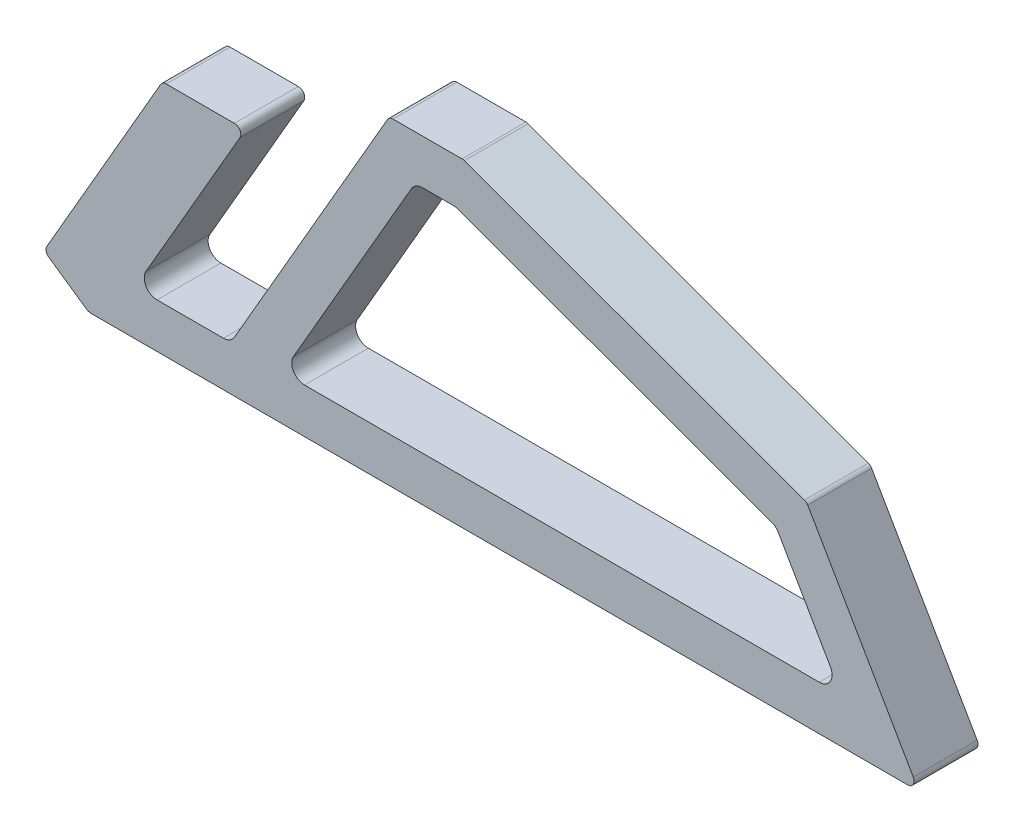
ISO-10303-21;
HEADER;
FILE_DESCRIPTION(('STEP AP214'),'2;1');
FILE_NAME('part.step','',(''),(''),'','','');
FILE_SCHEMA(('AUTOMOTIVE_DESIGN { 1 0 10303 214 1 1 1 1 }'));
ENDSEC;
DATA;
#1=APPLICATION_CONTEXT('core data for automotive mechanical design processes');
#2=APPLICATION_PROTOCOL_DEFINITION('international standard','automotive_design',2000,#1);
#3=PRODUCT_CONTEXT('',#1,'mechanical');
#4=PRODUCT('Part','Part','',(#3));
#5=PRODUCT_RELATED_PRODUCT_CATEGORY('part','',(#4));
#6=PRODUCT_DEFINITION_FORMATION('','',#4);
#7=PRODUCT_DEFINITION_CONTEXT('part definition',#1,'design');
#8=PRODUCT_DEFINITION('design','',#6,#7);
#9=PRODUCT_DEFINITION_SHAPE('','',#8);
#10=(LENGTH_UNIT() NAMED_UNIT(*) SI_UNIT(.MILLI.,.METRE.));
#11=(NAMED_UNIT(*) PLANE_ANGLE_UNIT() SI_UNIT($,.RADIAN.));
#12=(NAMED_UNIT(*) SI_UNIT($,.STERADIAN.) SOLID_ANGLE_UNIT());
#13=UNCERTAINTY_MEASURE_WITH_UNIT(LENGTH_MEASURE(1.E-05),#10,'distance_accuracy_value','');
#14=(GEOMETRIC_REPRESENTATION_CONTEXT(3) GLOBAL_UNCERTAINTY_ASSIGNED_CONTEXT((#13)) GLOBAL_UNIT_ASSIGNED_CONTEXT((#10,
#11,#12)) REPRESENTATION_CONTEXT('',''));
#15=CARTESIAN_POINT('',(0.,0.,0.));
#16=DIRECTION('',(0.,0.,1.));
#17=DIRECTION('',(1.,0.,0.));
#18=AXIS2_PLACEMENT_3D('',#15,#16,#17);
#19=CARTESIAN_POINT('',(0.,0.,10.));
#20=DIRECTION('',(0.,0.,-1.));
#21=DIRECTION('',(-1.,0.,0.));
#22=AXIS2_PLACEMENT_3D('',#19,#20,#21);
#23=PLANE('',#22);
#24=DIRECTION('',(-0.499999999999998,-0.86602540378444,0.));
#25=VECTOR('',#24,1.);
#26=CARTESIAN_POINT('',(-7.,4.83924431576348,10.));
#27=LINE('',#26,#25);
#28=CARTESIAN_POINT('',(11.2793458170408,36.5,10.));
#29=VERTEX_POINT('',#28);
#30=CARTESIAN_POINT('',(-6.53907278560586,5.63759366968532,10.));
#31=VERTEX_POINT('',#30);
#32=EDGE_CURVE('E251',#29,#31,#27,.T.);
#33=ORIENTED_EDGE('',*,*,#32,.T.);
#34=CARTESIAN_POINT('',(-5.67304738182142,5.13759366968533,10.));
#35=DIRECTION('',(0.,0.,-1.));
#36=DIRECTION('',(-1.,0.,0.));
#37=AXIS2_PLACEMENT_3D('',#34,#35,#36);
#38=CIRCLE('',#37,1.);
#39=CARTESIAN_POINT('',(-6.24170836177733,4.31502167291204,10.));
#40=VERTEX_POINT('',#39);
#41=EDGE_CURVE('E364',#31,#40,#38,.F.);
#42=ORIENTED_EDGE('',*,*,#41,.T.);
#43=DIRECTION('',(0.822571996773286,-0.568660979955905,0.));
#44=VECTOR('',#43,1.);
#45=CARTESIAN_POINT('',(-7.,4.83924431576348,10.));
#46=LINE('',#45,#44);
#47=CARTESIAN_POINT('',(-0.256650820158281,0.177428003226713,10.));
#48=VERTEX_POINT('',#47);
#49=EDGE_CURVE('E268',#40,#48,#46,.T.);
#50=ORIENTED_EDGE('',*,*,#49,.T.);
#51=CARTESIAN_POINT('',(0.312010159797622,1.,10.));
#52=DIRECTION('',(0.,0.,-1.));
#53=DIRECTION('',(-1.,0.,0.));
#54=AXIS2_PLACEMENT_3D('',#51,#52,#53);
#55=CIRCLE('',#54,1.);
#56=CARTESIAN_POINT('',(0.312010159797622,0.,10.));
#57=VERTEX_POINT('',#56);
#58=EDGE_CURVE('E354',#48,#57,#55,.F.);
#59=ORIENTED_EDGE('',*,*,#58,.T.);
#60=DIRECTION('',(1.,0.,0.));
#61=VECTOR('',#60,1.);
#62=CARTESIAN_POINT('',(0.,0.,10.));
#63=LINE('',#62,#61);
#64=CARTESIAN_POINT('',(128.267949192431,0.,10.));
#65=VERTEX_POINT('',#64);
#66=EDGE_CURVE('E452',#57,#65,#63,.T.);
#67=ORIENTED_EDGE('',*,*,#66,.T.);
#68=CARTESIAN_POINT('',(128.267949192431,1.,10.));
#69=DIRECTION('',(0.,0.,-1.));
#70=DIRECTION('',(-1.,0.,0.));
#71=AXIS2_PLACEMENT_3D('',#68,#69,#70);
#72=CIRCLE('',#71,1.);
#73=CARTESIAN_POINT('',(129.133974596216,1.5,10.));
#74=VERTEX_POINT('',#73);
#75=EDGE_CURVE('E356',#65,#74,#72,.F.);
#76=ORIENTED_EDGE('',*,*,#75,.T.);
#77=DIRECTION('',(-0.500000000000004,0.866025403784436,0.));
#78=VECTOR('',#77,1.);
#79=CARTESIAN_POINT('',(130.,0.,10.));
#80=LINE('',#79,#78);
#81=CARTESIAN_POINT('',(112.615245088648,30.1112787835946,10.));
#82=VERTEX_POINT('',#81);
#83=EDGE_CURVE('E449',#74,#82,#80,.T.);
#84=ORIENTED_EDGE('',*,*,#83,.T.);
#85=CARTESIAN_POINT('',(111.749219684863,29.6112787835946,10.));
#86=DIRECTION('',(0.,0.,-1.));
#87=DIRECTION('',(-1.,0.,0.));
#88=AXIS2_PLACEMENT_3D('',#85,#86,#87);
#89=CIRCLE('',#88,1.);
#90=CARTESIAN_POINT('',(112.091239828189,30.5509714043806,10.));
#91=VERTEX_POINT('',#90);
#92=EDGE_CURVE('E358',#82,#91,#89,.F.);
#93=ORIENTED_EDGE('',*,*,#92,.T.);
#94=DIRECTION('',(-0.93969262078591,0.342020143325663,0.));
#95=VECTOR('',#94,1.);
#96=CARTESIAN_POINT('',(112.433259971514,30.4264862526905,10.));
#97=LINE('',#96,#95);
#98=CARTESIAN_POINT('',(58.8211660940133,49.9396926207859,10.));
#99=VERTEX_POINT('',#98);
#100=EDGE_CURVE('E446',#91,#99,#97,.T.);
#101=ORIENTED_EDGE('',*,*,#100,.T.);
#102=CARTESIAN_POINT('',(58.4791459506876,49.,10.));
#103=DIRECTION('',(0.,0.,-1.));
#104=DIRECTION('',(-1.,0.,0.));
#105=AXIS2_PLACEMENT_3D('',#102,#103,#104);
#106=CIRCLE('',#105,1.);
#107=CARTESIAN_POINT('',(58.4791459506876,50.,10.));
#108=VERTEX_POINT('',#107);
#109=EDGE_CURVE('E360',#99,#108,#106,.F.);
#110=ORIENTED_EDGE('',*,*,#109,.T.);
#111=DIRECTION('',(-1.,0.,0.));
#112=VECTOR('',#111,1.);
#113=CARTESIAN_POINT('',(47.084681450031,50.,10.));
#114=LINE('',#113,#112);
#115=CARTESIAN_POINT('',(47.6620317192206,50.,10.));
#116=VERTEX_POINT('',#115);
#117=EDGE_CURVE('E441',#108,#116,#114,.T.);
#118=ORIENTED_EDGE('',*,*,#117,.T.);
#119=CARTESIAN_POINT('',(47.6620317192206,49.,10.));
#120=DIRECTION('',(0.,0.,-1.));
#121=DIRECTION('',(-1.,0.,0.));
#122=AXIS2_PLACEMENT_3D('',#119,#120,#121);
#123=CIRCLE('',#122,1.);
#124=CARTESIAN_POINT('',(46.7960063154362,49.5,10.));
#125=VERTEX_POINT('',#124);
#126=EDGE_CURVE('E362',#116,#125,#123,.F.);
#127=ORIENTED_EDGE('',*,*,#126,.T.);
#128=DIRECTION('',(-0.499999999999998,-0.86602540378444,0.));
#129=VECTOR('',#128,1.);
#130=CARTESIAN_POINT('',(47.084681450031,50.,10.));
#131=LINE('',#130,#129);
#132=CARTESIAN_POINT('',(22.8359701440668,8.00000000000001,10.));
#133=VERTEX_POINT('',#132);
#134=EDGE_CURVE('E437',#125,#133,#131,.T.);
#135=ORIENTED_EDGE('',*,*,#134,.T.);
#136=CARTESIAN_POINT('',(21.103919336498,8.99999999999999,10.));
#137=DIRECTION('',(0.,0.,-1.));
#138=DIRECTION('',(-1.,0.,0.));
#139=AXIS2_PLACEMENT_3D('',#136,#137,#138);
#140=CIRCLE('',#139,2.);
#141=CARTESIAN_POINT('',(21.103919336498,6.99999999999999,10.));
#142=VERTEX_POINT('',#141);
#143=EDGE_CURVE('E304',#133,#142,#140,.T.);
#144=ORIENTED_EDGE('',*,*,#143,.T.);
#145=DIRECTION('',(-1.,0.,0.));
#146=VECTOR('',#145,1.);
#147=CARTESIAN_POINT('',(22.2586198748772,6.99999999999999,10.));
#148=LINE('',#147,#146);
#149=CARTESIAN_POINT('',(10.7116144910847,7.,10.));
#150=VERTEX_POINT('',#149);
#151=EDGE_CURVE('E436',#142,#150,#148,.T.);
#152=ORIENTED_EDGE('',*,*,#151,.T.);
#153=CARTESIAN_POINT('',(10.7116144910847,9.,10.));
#154=DIRECTION('',(0.,0.,-1.));
#155=DIRECTION('',(-1.,0.,0.));
#156=AXIS2_PLACEMENT_3D('',#153,#154,#155);
#157=CIRCLE('',#156,2.);
#158=CARTESIAN_POINT('',(8.97956368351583,10.,10.));
#159=VERTEX_POINT('',#158);
#160=EDGE_CURVE('E240',#150,#159,#157,.T.);
#161=ORIENTED_EDGE('',*,*,#160,.T.);
#162=DIRECTION('',(0.499999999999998,0.86602540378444,0.));
#163=VECTOR('',#162,1.);
#164=CARTESIAN_POINT('',(24.5680209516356,37.,10.));
#165=LINE('',#164,#163);
#166=CARTESIAN_POINT('',(23.7019955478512,35.5,10.));
#167=VERTEX_POINT('',#166);
#168=EDGE_CURVE('E249',#159,#167,#165,.T.);
#169=ORIENTED_EDGE('',*,*,#168,.T.);
#170=CARTESIAN_POINT('',(22.8359701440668,36.,10.));
#171=DIRECTION('',(0.,0.,-1.));
#172=DIRECTION('',(-1.,0.,0.));
#173=AXIS2_PLACEMENT_3D('',#170,#171,#172);
#174=CIRCLE('',#173,1.);
#175=CARTESIAN_POINT('',(22.8359701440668,37.,10.));
#176=VERTEX_POINT('',#175);
#177=EDGE_CURVE('E54',#167,#176,#174,.F.);
#178=ORIENTED_EDGE('',*,*,#177,.T.);
#179=DIRECTION('',(-1.,0.,0.));
#180=VECTOR('',#179,1.);
#181=CARTESIAN_POINT('',(11.5680209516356,37.,10.));
#182=LINE('',#181,#180);
#183=CARTESIAN_POINT('',(12.1453712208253,37.,10.));
#184=VERTEX_POINT('',#183);
#185=EDGE_CURVE('E392',#176,#184,#182,.T.);
#186=ORIENTED_EDGE('',*,*,#185,.T.);
#187=CARTESIAN_POINT('',(12.1453712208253,36.,10.));
#188=DIRECTION('',(0.,0.,-1.));
#189=DIRECTION('',(-1.,0.,0.));
#190=AXIS2_PLACEMENT_3D('',#187,#188,#189);
#191=CIRCLE('',#190,1.);
#192=EDGE_CURVE('E351',#184,#29,#191,.F.);
#193=ORIENTED_EDGE('',*,*,#192,.T.);
#194=EDGE_LOOP('',(#33,#42,#50,#59,#67,#76,#84,#93,#101,#110,#118,#127,#135,#144,#152,#161,#169,
#178,#186,#193));
#195=FACE_BOUND('',#194,.T.);
#196=DIRECTION('',(-0.500000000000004,0.866025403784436,0.));
#197=VECTOR('',#196,1.);
#198=CARTESIAN_POINT('',(117.875644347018,7.,10.));
#199=LINE('',#198,#197);
#200=CARTESIAN_POINT('',(116.143593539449,10.,10.));
#201=VERTEX_POINT('',#200);
#202=CARTESIAN_POINT('',(108.008948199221,24.0896190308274,10.));
#203=VERTEX_POINT('',#202);
#204=EDGE_CURVE('E460',#201,#203,#199,.T.);
#205=ORIENTED_EDGE('',*,*,#204,.F.);
#206=CARTESIAN_POINT('',(114.41154273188,9.,10.));
#207=DIRECTION('',(0.,0.,-1.));
#208=DIRECTION('',(-1.,0.,0.));
#209=AXIS2_PLACEMENT_3D('',#206,#207,#208);
#210=CIRCLE('',#209,2.);
#211=CARTESIAN_POINT('',(114.41154273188,7.,10.));
#212=VERTEX_POINT('',#211);
#213=EDGE_CURVE('E316',#201,#212,#210,.T.);
#214=ORIENTED_EDGE('',*,*,#213,.T.);
#215=DIRECTION('',(1.,0.,0.));
#216=VECTOR('',#215,1.);
#217=CARTESIAN_POINT('',(30.341523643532,7.,10.));
#218=LINE('',#217,#216);
#219=CARTESIAN_POINT('',(33.8056252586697,7.,10.));
#220=VERTEX_POINT('',#219);
#221=EDGE_CURVE('E412',#220,#212,#218,.T.);
#222=ORIENTED_EDGE('',*,*,#221,.F.);
#223=CARTESIAN_POINT('',(33.8056252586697,9.,10.));
#224=DIRECTION('',(0.,0.,-1.));
#225=DIRECTION('',(-1.,0.,0.));
#226=AXIS2_PLACEMENT_3D('',#223,#224,#225);
#227=CIRCLE('',#226,2.);
#228=CARTESIAN_POINT('',(32.0735744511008,9.99999999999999,10.));
#229=VERTEX_POINT('',#228);
#230=EDGE_CURVE('E312',#220,#229,#227,.T.);
#231=ORIENTED_EDGE('',*,*,#230,.T.);
#232=DIRECTION('',(-0.499999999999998,-0.86602540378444,0.));
#233=VECTOR('',#232,1.);
#234=CARTESIAN_POINT('',(51.1261333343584,43.,10.));
#235=LINE('',#234,#233);
#236=CARTESIAN_POINT('',(50.5487830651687,42.,10.));
#237=VERTEX_POINT('',#236);
#238=EDGE_CURVE('E475',#237,#229,#235,.T.);
#239=ORIENTED_EDGE('',*,*,#238,.F.);
#240=CARTESIAN_POINT('',(52.2808338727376,41.,10.));
#241=DIRECTION('',(0.,0.,-1.));
#242=DIRECTION('',(-1.,0.,0.));
#243=AXIS2_PLACEMENT_3D('',#240,#241,#242);
#244=CIRCLE('',#243,2.);
#245=CARTESIAN_POINT('',(52.2808338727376,43.,10.));
#246=VERTEX_POINT('',#245);
#247=EDGE_CURVE('E320',#237,#246,#244,.T.);
#248=ORIENTED_EDGE('',*,*,#247,.T.);
#249=DIRECTION('',(-1.,0.,0.));
#250=VECTOR('',#249,1.);
#251=CARTESIAN_POINT('',(51.1261333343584,43.,10.));
#252=LINE('',#251,#250);
#253=CARTESIAN_POINT('',(57.06853010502,43.,10.));
#254=VERTEX_POINT('',#253);
#255=EDGE_CURVE('E478',#254,#246,#252,.T.);
#256=ORIENTED_EDGE('',*,*,#255,.F.);
#257=CARTESIAN_POINT('',(57.06853010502,41.,10.));
#258=DIRECTION('',(0.,0.,-1.));
#259=DIRECTION('',(-1.,0.,0.));
#260=AXIS2_PLACEMENT_3D('',#257,#258,#259);
#261=CIRCLE('',#260,2.);
#262=CARTESIAN_POINT('',(57.7525703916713,42.8793852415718,10.));
#263=VERTEX_POINT('',#262);
#264=EDGE_CURVE('E324',#254,#263,#261,.T.);
#265=ORIENTED_EDGE('',*,*,#264,.T.);
#266=DIRECTION('',(-0.939692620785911,0.342020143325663,0.));
#267=VECTOR('',#266,1.);
#268=CARTESIAN_POINT('',(107.644977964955,24.7200339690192,10.));
#269=LINE('',#268,#267);
#270=CARTESIAN_POINT('',(106.960937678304,24.9690042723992,10.));
#271=VERTEX_POINT('',#270);
#272=EDGE_CURVE('E481',#271,#263,#269,.T.);
#273=ORIENTED_EDGE('',*,*,#272,.F.);
#274=CARTESIAN_POINT('',(106.276897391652,23.0896190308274,10.));
#275=DIRECTION('',(0.,0.,-1.));
#276=DIRECTION('',(-1.,0.,0.));
#277=AXIS2_PLACEMENT_3D('',#274,#275,#276);
#278=CIRCLE('',#277,2.);
#279=EDGE_CURVE('E308',#271,#203,#278,.T.);
#280=ORIENTED_EDGE('',*,*,#279,.T.);
#281=EDGE_LOOP('',(#205,#214,#222,#231,#239,#248,#256,#265,#273,#280));
#282=FACE_BOUND('',#281,.T.);
#283=ADVANCED_FACE('F32',(#195,#282),#23,.F.);
#284=CARTESIAN_POINT('',(0.,0.,0.));
#285=DIRECTION('',(0.,0.,-1.));
#286=DIRECTION('',(-1.,0.,0.));
#287=AXIS2_PLACEMENT_3D('',#284,#285,#286);
#288=PLANE('',#287);
#289=DIRECTION('',(0.822571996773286,-0.568660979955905,0.));
#290=VECTOR('',#289,1.);
#291=CARTESIAN_POINT('',(-7.,4.83924431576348,0.));
#292=LINE('',#291,#290);
#293=CARTESIAN_POINT('',(-6.24170836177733,4.31502167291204,0.));
#294=VERTEX_POINT('',#293);
#295=CARTESIAN_POINT('',(-0.256650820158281,0.177428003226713,0.));
#296=VERTEX_POINT('',#295);
#297=EDGE_CURVE('E408',#294,#296,#292,.T.);
#298=ORIENTED_EDGE('',*,*,#297,.F.);
#299=CARTESIAN_POINT('',(-5.67304738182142,5.13759366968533,0.));
#300=DIRECTION('',(0.,0.,-1.));
#301=DIRECTION('',(-1.,0.,0.));
#302=AXIS2_PLACEMENT_3D('',#299,#300,#301);
#303=CIRCLE('',#302,1.);
#304=CARTESIAN_POINT('',(-6.53907278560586,5.63759366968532,0.));
#305=VERTEX_POINT('',#304);
#306=EDGE_CURVE('E344',#294,#305,#303,.T.);
#307=ORIENTED_EDGE('',*,*,#306,.T.);
#308=DIRECTION('',(-0.499999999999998,-0.86602540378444,0.));
#309=VECTOR('',#308,1.);
#310=CARTESIAN_POINT('',(-7.,4.83924431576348,0.));
#311=LINE('',#310,#309);
#312=CARTESIAN_POINT('',(11.2793458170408,36.5,0.));
#313=VERTEX_POINT('',#312);
#314=EDGE_CURVE('E261',#313,#305,#311,.T.);
#315=ORIENTED_EDGE('',*,*,#314,.F.);
#316=CARTESIAN_POINT('',(12.1453712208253,36.,0.));
#317=DIRECTION('',(0.,0.,-1.));
#318=DIRECTION('',(-1.,0.,0.));
#319=AXIS2_PLACEMENT_3D('',#316,#317,#318);
#320=CIRCLE('',#319,1.);
#321=CARTESIAN_POINT('',(12.1453712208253,37.,0.));
#322=VERTEX_POINT('',#321);
#323=EDGE_CURVE('E331',#313,#322,#320,.T.);
#324=ORIENTED_EDGE('',*,*,#323,.T.);
#325=DIRECTION('',(-1.,0.,0.));
#326=VECTOR('',#325,1.);
#327=CARTESIAN_POINT('',(11.5680209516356,37.,0.));
#328=LINE('',#327,#326);
#329=CARTESIAN_POINT('',(22.8359701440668,37.,0.));
#330=VERTEX_POINT('',#329);
#331=EDGE_CURVE('E258',#330,#322,#328,.T.);
#332=ORIENTED_EDGE('',*,*,#331,.F.);
#333=CARTESIAN_POINT('',(22.8359701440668,36.,0.));
#334=DIRECTION('',(0.,0.,-1.));
#335=DIRECTION('',(-1.,0.,0.));
#336=AXIS2_PLACEMENT_3D('',#333,#334,#335);
#337=CIRCLE('',#336,1.);
#338=CARTESIAN_POINT('',(23.7019955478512,35.5,0.));
#339=VERTEX_POINT('',#338);
#340=EDGE_CURVE('E257',#330,#339,#337,.T.);
#341=ORIENTED_EDGE('',*,*,#340,.T.);
#342=DIRECTION('',(0.499999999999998,0.86602540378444,0.));
#343=VECTOR('',#342,1.);
#344=CARTESIAN_POINT('',(24.5680209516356,37.,0.));
#345=LINE('',#344,#343);
#346=CARTESIAN_POINT('',(8.97956368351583,10.,0.));
#347=VERTEX_POINT('',#346);
#348=EDGE_CURVE('E247',#347,#339,#345,.T.);
#349=ORIENTED_EDGE('',*,*,#348,.F.);
#350=CARTESIAN_POINT('',(10.7116144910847,9.,0.));
#351=DIRECTION('',(0.,0.,-1.));
#352=DIRECTION('',(-1.,0.,0.));
#353=AXIS2_PLACEMENT_3D('',#350,#351,#352);
#354=CIRCLE('',#353,2.);
#355=CARTESIAN_POINT('',(10.7116144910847,7.,0.));
#356=VERTEX_POINT('',#355);
#357=EDGE_CURVE('E230',#347,#356,#354,.F.);
#358=ORIENTED_EDGE('',*,*,#357,.T.);
#359=DIRECTION('',(-1.,0.,0.));
#360=VECTOR('',#359,1.);
#361=CARTESIAN_POINT('',(22.2586198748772,6.99999999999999,0.));
#362=LINE('',#361,#360);
#363=CARTESIAN_POINT('',(21.103919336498,6.99999999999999,0.));
#364=VERTEX_POINT('',#363);
#365=EDGE_CURVE('E259',#364,#356,#362,.T.);
#366=ORIENTED_EDGE('',*,*,#365,.F.);
#367=CARTESIAN_POINT('',(21.103919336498,8.99999999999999,0.));
#368=DIRECTION('',(0.,0.,-1.));
#369=DIRECTION('',(-1.,0.,0.));
#370=AXIS2_PLACEMENT_3D('',#367,#368,#369);
#371=CIRCLE('',#370,2.);
#372=CARTESIAN_POINT('',(22.8359701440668,8.00000000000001,0.));
#373=VERTEX_POINT('',#372);
#374=EDGE_CURVE('E301',#364,#373,#371,.F.);
#375=ORIENTED_EDGE('',*,*,#374,.T.);
#376=DIRECTION('',(-0.499999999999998,-0.86602540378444,0.));
#377=VECTOR('',#376,1.);
#378=CARTESIAN_POINT('',(47.084681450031,50.,0.));
#379=LINE('',#378,#377);
#380=CARTESIAN_POINT('',(46.7960063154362,49.5,0.));
#381=VERTEX_POINT('',#380);
#382=EDGE_CURVE('E263',#381,#373,#379,.T.);
#383=ORIENTED_EDGE('',*,*,#382,.F.);
#384=CARTESIAN_POINT('',(47.6620317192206,49.,0.));
#385=DIRECTION('',(0.,0.,-1.));
#386=DIRECTION('',(-1.,0.,0.));
#387=AXIS2_PLACEMENT_3D('',#384,#385,#386);
#388=CIRCLE('',#387,1.);
#389=CARTESIAN_POINT('',(47.6620317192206,50.,0.));
#390=VERTEX_POINT('',#389);
#391=EDGE_CURVE('E342',#381,#390,#388,.T.);
#392=ORIENTED_EDGE('',*,*,#391,.T.);
#393=DIRECTION('',(-1.,0.,0.));
#394=VECTOR('',#393,1.);
#395=CARTESIAN_POINT('',(47.084681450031,50.,0.));
#396=LINE('',#395,#394);
#397=CARTESIAN_POINT('',(58.4791459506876,50.,0.));
#398=VERTEX_POINT('',#397);
#399=EDGE_CURVE('E421',#398,#390,#396,.T.);
#400=ORIENTED_EDGE('',*,*,#399,.F.);
#401=CARTESIAN_POINT('',(58.4791459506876,49.,0.));
#402=DIRECTION('',(0.,0.,-1.));
#403=DIRECTION('',(-1.,0.,0.));
#404=AXIS2_PLACEMENT_3D('',#401,#402,#403);
#405=CIRCLE('',#404,1.);
#406=CARTESIAN_POINT('',(58.8211660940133,49.9396926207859,0.));
#407=VERTEX_POINT('',#406);
#408=EDGE_CURVE('E340',#398,#407,#405,.T.);
#409=ORIENTED_EDGE('',*,*,#408,.T.);
#410=DIRECTION('',(-0.93969262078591,0.342020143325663,0.));
#411=VECTOR('',#410,1.);
#412=CARTESIAN_POINT('',(112.433259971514,30.4264862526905,0.));
#413=LINE('',#412,#411);
#414=CARTESIAN_POINT('',(112.091239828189,30.5509714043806,0.));
#415=VERTEX_POINT('',#414);
#416=EDGE_CURVE('E418',#415,#407,#413,.T.);
#417=ORIENTED_EDGE('',*,*,#416,.F.);
#418=CARTESIAN_POINT('',(111.749219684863,29.6112787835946,0.));
#419=DIRECTION('',(0.,0.,-1.));
#420=DIRECTION('',(-1.,0.,0.));
#421=AXIS2_PLACEMENT_3D('',#418,#419,#420);
#422=CIRCLE('',#421,1.);
#423=CARTESIAN_POINT('',(112.615245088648,30.1112787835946,0.));
#424=VERTEX_POINT('',#423);
#425=EDGE_CURVE('E338',#415,#424,#422,.T.);
#426=ORIENTED_EDGE('',*,*,#425,.T.);
#427=DIRECTION('',(-0.500000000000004,0.866025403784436,0.));
#428=VECTOR('',#427,1.);
#429=CARTESIAN_POINT('',(130.,0.,0.));
#430=LINE('',#429,#428);
#431=CARTESIAN_POINT('',(129.133974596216,1.5,0.));
#432=VERTEX_POINT('',#431);
#433=EDGE_CURVE('E415',#432,#424,#430,.T.);
#434=ORIENTED_EDGE('',*,*,#433,.F.);
#435=CARTESIAN_POINT('',(128.267949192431,1.,0.));
#436=DIRECTION('',(0.,0.,-1.));
#437=DIRECTION('',(-1.,0.,0.));
#438=AXIS2_PLACEMENT_3D('',#435,#436,#437);
#439=CIRCLE('',#438,1.);
#440=CARTESIAN_POINT('',(128.267949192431,0.,0.));
#441=VERTEX_POINT('',#440);
#442=EDGE_CURVE('E336',#432,#441,#439,.T.);
#443=ORIENTED_EDGE('',*,*,#442,.T.);
#444=DIRECTION('',(1.,0.,0.));
#445=VECTOR('',#444,1.);
#446=CARTESIAN_POINT('',(0.,0.,0.));
#447=LINE('',#446,#445);
#448=CARTESIAN_POINT('',(0.312010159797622,0.,0.));
#449=VERTEX_POINT('',#448);
#450=EDGE_CURVE('E411',#449,#441,#447,.T.);
#451=ORIENTED_EDGE('',*,*,#450,.F.);
#452=CARTESIAN_POINT('',(0.312010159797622,1.,0.));
#453=DIRECTION('',(0.,0.,-1.));
#454=DIRECTION('',(-1.,0.,0.));
#455=AXIS2_PLACEMENT_3D('',#452,#453,#454);
#456=CIRCLE('',#455,1.);
#457=EDGE_CURVE('E334',#449,#296,#456,.T.);
#458=ORIENTED_EDGE('',*,*,#457,.T.);
#459=EDGE_LOOP('',(#298,#307,#315,#324,#332,#341,#349,#358,#366,#375,#383,#392,#400,#409,#417,
#426,#434,#443,#451,#458));
#460=FACE_BOUND('',#459,.T.);
#461=DIRECTION('',(-0.499999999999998,-0.86602540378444,0.));
#462=VECTOR('',#461,1.);
#463=CARTESIAN_POINT('',(51.1261333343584,43.,0.));
#464=LINE('',#463,#462);
#465=CARTESIAN_POINT('',(50.5487830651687,42.,0.));
#466=VERTEX_POINT('',#465);
#467=CARTESIAN_POINT('',(32.0735744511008,9.99999999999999,0.));
#468=VERTEX_POINT('',#467);
#469=EDGE_CURVE('E461',#466,#468,#464,.T.);
#470=ORIENTED_EDGE('',*,*,#469,.T.);
#471=CARTESIAN_POINT('',(33.8056252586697,9.,0.));
#472=DIRECTION('',(0.,0.,-1.));
#473=DIRECTION('',(-1.,0.,0.));
#474=AXIS2_PLACEMENT_3D('',#471,#472,#473);
#475=CIRCLE('',#474,2.);
#476=CARTESIAN_POINT('',(33.8056252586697,7.,0.));
#477=VERTEX_POINT('',#476);
#478=EDGE_CURVE('E310',#468,#477,#475,.F.);
#479=ORIENTED_EDGE('',*,*,#478,.T.);
#480=DIRECTION('',(1.,0.,0.));
#481=VECTOR('',#480,1.);
#482=CARTESIAN_POINT('',(30.341523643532,7.,0.));
#483=LINE('',#482,#481);
#484=CARTESIAN_POINT('',(114.41154273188,7.,0.));
#485=VERTEX_POINT('',#484);
#486=EDGE_CURVE('E457',#477,#485,#483,.T.);
#487=ORIENTED_EDGE('',*,*,#486,.T.);
#488=CARTESIAN_POINT('',(114.41154273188,9.,0.));
#489=DIRECTION('',(0.,0.,-1.));
#490=DIRECTION('',(-1.,0.,0.));
#491=AXIS2_PLACEMENT_3D('',#488,#489,#490);
#492=CIRCLE('',#491,2.);
#493=CARTESIAN_POINT('',(116.143593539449,10.,0.));
#494=VERTEX_POINT('',#493);
#495=EDGE_CURVE('E314',#485,#494,#492,.F.);
#496=ORIENTED_EDGE('',*,*,#495,.T.);
#497=DIRECTION('',(-0.500000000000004,0.866025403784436,0.));
#498=VECTOR('',#497,1.);
#499=CARTESIAN_POINT('',(117.875644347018,7.,0.));
#500=LINE('',#499,#498);
#501=CARTESIAN_POINT('',(108.008948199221,24.0896190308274,0.));
#502=VERTEX_POINT('',#501);
#503=EDGE_CURVE('E470',#494,#502,#500,.T.);
#504=ORIENTED_EDGE('',*,*,#503,.T.);
#505=CARTESIAN_POINT('',(106.276897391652,23.0896190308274,0.));
#506=DIRECTION('',(0.,0.,-1.));
#507=DIRECTION('',(-1.,0.,0.));
#508=AXIS2_PLACEMENT_3D('',#505,#506,#507);
#509=CIRCLE('',#508,2.);
#510=CARTESIAN_POINT('',(106.960937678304,24.9690042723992,0.));
#511=VERTEX_POINT('',#510);
#512=EDGE_CURVE('E306',#502,#511,#509,.F.);
#513=ORIENTED_EDGE('',*,*,#512,.T.);
#514=DIRECTION('',(-0.939692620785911,0.342020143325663,0.));
#515=VECTOR('',#514,1.);
#516=CARTESIAN_POINT('',(107.644977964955,24.7200339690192,0.));
#517=LINE('',#516,#515);
#518=CARTESIAN_POINT('',(57.7525703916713,42.8793852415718,0.));
#519=VERTEX_POINT('',#518);
#520=EDGE_CURVE('E467',#511,#519,#517,.T.);
#521=ORIENTED_EDGE('',*,*,#520,.T.);
#522=CARTESIAN_POINT('',(57.06853010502,41.,0.));
#523=DIRECTION('',(0.,0.,-1.));
#524=DIRECTION('',(-1.,0.,0.));
#525=AXIS2_PLACEMENT_3D('',#522,#523,#524);
#526=CIRCLE('',#525,2.);
#527=CARTESIAN_POINT('',(57.06853010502,43.,0.));
#528=VERTEX_POINT('',#527);
#529=EDGE_CURVE('E322',#519,#528,#526,.F.);
#530=ORIENTED_EDGE('',*,*,#529,.T.);
#531=DIRECTION('',(-1.,0.,0.));
#532=VECTOR('',#531,1.);
#533=CARTESIAN_POINT('',(51.1261333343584,43.,0.));
#534=LINE('',#533,#532);
#535=CARTESIAN_POINT('',(52.2808338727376,43.,0.));
#536=VERTEX_POINT('',#535);
#537=EDGE_CURVE('E464',#528,#536,#534,.T.);
#538=ORIENTED_EDGE('',*,*,#537,.T.);
#539=CARTESIAN_POINT('',(52.2808338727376,41.,0.));
#540=DIRECTION('',(0.,0.,-1.));
#541=DIRECTION('',(-1.,0.,0.));
#542=AXIS2_PLACEMENT_3D('',#539,#540,#541);
#543=CIRCLE('',#542,2.);
#544=EDGE_CURVE('E318',#536,#466,#543,.F.);
#545=ORIENTED_EDGE('',*,*,#544,.T.);
#546=EDGE_LOOP('',(#470,#479,#487,#496,#504,#513,#521,#530,#538,#545));
#547=FACE_BOUND('',#546,.T.);
#548=ADVANCED_FACE('F254',(#460,#547),#288,.T.);
#549=CARTESIAN_POINT('',(-7.,4.83924431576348,10.));
#550=DIRECTION('',(0.568660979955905,0.822571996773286,0.));
#551=DIRECTION('',(-0.822571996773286,0.568660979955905,0.));
#552=AXIS2_PLACEMENT_3D('',#549,#550,#551);
#553=PLANE('',#552);
#554=ORIENTED_EDGE('',*,*,#49,.F.);
#555=DIRECTION('',(0.,0.,-1.));
#556=VECTOR('',#555,1.);
#557=CARTESIAN_POINT('',(-6.24170836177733,4.31502167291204,10.));
#558=LINE('',#557,#556);
#559=EDGE_CURVE('E328',#40,#294,#558,.T.);
#560=ORIENTED_EDGE('',*,*,#559,.T.);
#561=ORIENTED_EDGE('',*,*,#297,.T.);
#562=DIRECTION('',(0.,0.,-1.));
#563=VECTOR('',#562,1.);
#564=CARTESIAN_POINT('',(-0.256650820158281,0.177428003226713,10.));
#565=LINE('',#564,#563);
#566=EDGE_CURVE('E326',#296,#48,#565,.F.);
#567=ORIENTED_EDGE('',*,*,#566,.T.);
#568=EDGE_LOOP('',(#554,#560,#561,#567));
#569=FACE_BOUND('',#568,.T.);
#570=ADVANCED_FACE('F535',(#569),#553,.F.);
#571=CARTESIAN_POINT('',(0.,0.,10.));
#572=DIRECTION('',(0.,1.,0.));
#573=DIRECTION('',(0.,0.,1.));
#574=AXIS2_PLACEMENT_3D('',#571,#572,#573);
#575=PLANE('',#574);
#576=ORIENTED_EDGE('',*,*,#450,.T.);
#577=DIRECTION('',(0.,0.,-1.));
#578=VECTOR('',#577,1.);
#579=CARTESIAN_POINT('',(128.267949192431,0.,10.));
#580=LINE('',#579,#578);
#581=EDGE_CURVE('E387',#441,#65,#580,.F.);
#582=ORIENTED_EDGE('',*,*,#581,.T.);
#583=ORIENTED_EDGE('',*,*,#66,.F.);
#584=DIRECTION('',(0.,0.,-1.));
#585=VECTOR('',#584,1.);
#586=CARTESIAN_POINT('',(0.312010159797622,0.,10.));
#587=LINE('',#586,#585);
#588=EDGE_CURVE('E384',#57,#449,#587,.T.);
#589=ORIENTED_EDGE('',*,*,#588,.T.);
#590=EDGE_LOOP('',(#576,#582,#583,#589));
#591=FACE_BOUND('',#590,.T.);
#592=ADVANCED_FACE('F561',(#591),#575,.F.);
#593=CARTESIAN_POINT('',(130.,0.,10.));
#594=DIRECTION('',(-0.866025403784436,-0.500000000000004,0.));
#595=DIRECTION('',(0.500000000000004,-0.866025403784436,0.));
#596=AXIS2_PLACEMENT_3D('',#593,#594,#595);
#597=PLANE('',#596);
#598=ORIENTED_EDGE('',*,*,#433,.T.);
#599=DIRECTION('',(0.,0.,-1.));
#600=VECTOR('',#599,1.);
#601=CARTESIAN_POINT('',(112.615245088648,30.1112787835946,10.));
#602=LINE('',#601,#600);
#603=EDGE_CURVE('E382',#424,#82,#602,.F.);
#604=ORIENTED_EDGE('',*,*,#603,.T.);
#605=ORIENTED_EDGE('',*,*,#83,.F.);
#606=DIRECTION('',(0.,0.,-1.));
#607=VECTOR('',#606,1.);
#608=CARTESIAN_POINT('',(129.133974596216,1.5,10.));
#609=LINE('',#608,#607);
#610=EDGE_CURVE('E379',#74,#432,#609,.T.);
#611=ORIENTED_EDGE('',*,*,#610,.T.);
#612=EDGE_LOOP('',(#598,#604,#605,#611));
#613=FACE_BOUND('',#612,.T.);
#614=ADVANCED_FACE('F557',(#613),#597,.F.);
#615=CARTESIAN_POINT('',(112.433259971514,30.4264862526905,10.));
#616=DIRECTION('',(-0.342020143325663,-0.93969262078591,0.));
#617=DIRECTION('',(0.939692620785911,-0.342020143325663,0.));
#618=AXIS2_PLACEMENT_3D('',#615,#616,#617);
#619=PLANE('',#618);
#620=ORIENTED_EDGE('',*,*,#416,.T.);
#621=DIRECTION('',(0.,0.,-1.));
#622=VECTOR('',#621,1.);
#623=CARTESIAN_POINT('',(58.8211660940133,49.9396926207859,10.));
#624=LINE('',#623,#622);
#625=EDGE_CURVE('E377',#407,#99,#624,.F.);
#626=ORIENTED_EDGE('',*,*,#625,.T.);
#627=ORIENTED_EDGE('',*,*,#100,.F.);
#628=DIRECTION('',(0.,0.,-1.));
#629=VECTOR('',#628,1.);
#630=CARTESIAN_POINT('',(112.091239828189,30.5509714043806,10.));
#631=LINE('',#630,#629);
#632=EDGE_CURVE('E374',#91,#415,#631,.T.);
#633=ORIENTED_EDGE('',*,*,#632,.T.);
#634=EDGE_LOOP('',(#620,#626,#627,#633));
#635=FACE_BOUND('',#634,.T.);
#636=ADVANCED_FACE('F553',(#635),#619,.F.);
#637=CARTESIAN_POINT('',(47.084681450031,50.,10.));
#638=DIRECTION('',(0.,-1.,0.));
#639=DIRECTION('',(0.,0.,-1.));
#640=AXIS2_PLACEMENT_3D('',#637,#638,#639);
#641=PLANE('',#640);
#642=ORIENTED_EDGE('',*,*,#399,.T.);
#643=DIRECTION('',(0.,0.,-1.));
#644=VECTOR('',#643,1.);
#645=CARTESIAN_POINT('',(47.6620317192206,50.,10.));
#646=LINE('',#645,#644);
#647=EDGE_CURVE('E372',#390,#116,#646,.F.);
#648=ORIENTED_EDGE('',*,*,#647,.T.);
#649=ORIENTED_EDGE('',*,*,#117,.F.);
#650=DIRECTION('',(0.,0.,-1.));
#651=VECTOR('',#650,1.);
#652=CARTESIAN_POINT('',(58.4791459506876,50.,10.));
#653=LINE('',#652,#651);
#654=EDGE_CURVE('E369',#108,#398,#653,.T.);
#655=ORIENTED_EDGE('',*,*,#654,.T.);
#656=EDGE_LOOP('',(#642,#648,#649,#655));
#657=FACE_BOUND('',#656,.T.);
#658=ADVANCED_FACE('F550',(#657),#641,.F.);
#659=CARTESIAN_POINT('',(47.084681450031,50.,10.));
#660=DIRECTION('',(0.86602540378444,-0.499999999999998,0.));
#661=DIRECTION('',(0.499999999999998,0.86602540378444,0.));
#662=AXIS2_PLACEMENT_3D('',#659,#660,#661);
#663=PLANE('',#662);
#664=ORIENTED_EDGE('',*,*,#134,.F.);
#665=DIRECTION('',(0.,0.,-1.));
#666=VECTOR('',#665,1.);
#667=CARTESIAN_POINT('',(46.7960063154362,49.5,10.));
#668=LINE('',#667,#666);
#669=EDGE_CURVE('E366',#125,#381,#668,.T.);
#670=ORIENTED_EDGE('',*,*,#669,.T.);
#671=ORIENTED_EDGE('',*,*,#382,.T.);
#672=DIRECTION('',(0.,0.,-1.));
#673=VECTOR('',#672,1.);
#674=CARTESIAN_POINT('',(22.8359701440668,8.,10.));
#675=LINE('',#674,#673);
#676=EDGE_CURVE('E273',#373,#133,#675,.F.);
#677=ORIENTED_EDGE('',*,*,#676,.T.);
#678=EDGE_LOOP('',(#664,#670,#671,#677));
#679=FACE_BOUND('',#678,.T.);
#680=ADVANCED_FACE('F426',(#679),#663,.F.);
#681=CARTESIAN_POINT('',(22.2586198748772,6.99999999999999,10.));
#682=DIRECTION('',(0.,-1.,0.));
#683=DIRECTION('',(1.,0.,0.));
#684=AXIS2_PLACEMENT_3D('',#681,#682,#683);
#685=PLANE('',#684);
#686=ORIENTED_EDGE('',*,*,#365,.T.);
#687=DIRECTION('',(0.,0.,-1.));
#688=VECTOR('',#687,1.);
#689=CARTESIAN_POINT('',(10.7116144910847,7.,10.));
#690=LINE('',#689,#688);
#691=EDGE_CURVE('E235',#356,#150,#690,.F.);
#692=ORIENTED_EDGE('',*,*,#691,.T.);
#693=ORIENTED_EDGE('',*,*,#151,.F.);
#694=DIRECTION('',(0.,0.,-1.));
#695=VECTOR('',#694,1.);
#696=CARTESIAN_POINT('',(21.103919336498,6.99999999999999,0.));
#697=LINE('',#696,#695);
#698=EDGE_CURVE('E250',#142,#364,#697,.T.);
#699=ORIENTED_EDGE('',*,*,#698,.T.);
#700=EDGE_LOOP('',(#686,#692,#693,#699));
#701=FACE_BOUND('',#700,.T.);
#702=ADVANCED_FACE('F439',(#701),#685,.F.);
#703=CARTESIAN_POINT('',(24.5680209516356,37.,10.));
#704=DIRECTION('',(-0.86602540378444,0.499999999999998,0.));
#705=DIRECTION('',(-0.499999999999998,-0.86602540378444,0.));
#706=AXIS2_PLACEMENT_3D('',#703,#704,#705);
#707=PLANE('',#706);
#708=ORIENTED_EDGE('',*,*,#348,.T.);
#709=DIRECTION('',(0.,0.,-1.));
#710=VECTOR('',#709,1.);
#711=CARTESIAN_POINT('',(23.7019955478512,35.5,10.));
#712=LINE('',#711,#710);
#713=EDGE_CURVE('E11',#339,#167,#712,.F.);
#714=ORIENTED_EDGE('',*,*,#713,.T.);
#715=ORIENTED_EDGE('',*,*,#168,.F.);
#716=DIRECTION('',(0.,0.,-1.));
#717=VECTOR('',#716,1.);
#718=CARTESIAN_POINT('',(8.97956368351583,9.99999999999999,0.));
#719=LINE('',#718,#717);
#720=EDGE_CURVE('E234',#159,#347,#719,.T.);
#721=ORIENTED_EDGE('',*,*,#720,.T.);
#722=EDGE_LOOP('',(#708,#714,#715,#721));
#723=FACE_BOUND('',#722,.T.);
#724=ADVANCED_FACE('F246',(#723),#707,.F.);
#725=CARTESIAN_POINT('',(11.5680209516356,37.,10.));
#726=DIRECTION('',(0.,-1.,0.));
#727=DIRECTION('',(1.,0.,0.));
#728=AXIS2_PLACEMENT_3D('',#725,#726,#727);
#729=PLANE('',#728);
#730=ORIENTED_EDGE('',*,*,#185,.F.);
#731=DIRECTION('',(0.,0.,-1.));
#732=VECTOR('',#731,1.);
#733=CARTESIAN_POINT('',(22.8359701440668,37.,10.));
#734=LINE('',#733,#732);
#735=EDGE_CURVE('E40',#176,#330,#734,.T.);
#736=ORIENTED_EDGE('',*,*,#735,.T.);
#737=ORIENTED_EDGE('',*,*,#331,.T.);
#738=DIRECTION('',(0.,0.,-1.));
#739=VECTOR('',#738,1.);
#740=CARTESIAN_POINT('',(12.1453712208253,37.,10.));
#741=LINE('',#740,#739);
#742=EDGE_CURVE('E47',#322,#184,#741,.F.);
#743=ORIENTED_EDGE('',*,*,#742,.T.);
#744=EDGE_LOOP('',(#730,#736,#737,#743));
#745=FACE_BOUND('',#744,.T.);
#746=ADVANCED_FACE('F391',(#745),#729,.F.);
#747=CARTESIAN_POINT('',(-7.,4.83924431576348,10.));
#748=DIRECTION('',(0.86602540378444,-0.499999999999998,0.));
#749=DIRECTION('',(0.499999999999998,0.86602540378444,0.));
#750=AXIS2_PLACEMENT_3D('',#747,#748,#749);
#751=PLANE('',#750);
#752=ORIENTED_EDGE('',*,*,#314,.T.);
#753=DIRECTION('',(0.,0.,-1.));
#754=VECTOR('',#753,1.);
#755=CARTESIAN_POINT('',(-6.53907278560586,5.63759366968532,10.));
#756=LINE('',#755,#754);
#757=EDGE_CURVE('E349',#305,#31,#756,.F.);
#758=ORIENTED_EDGE('',*,*,#757,.T.);
#759=ORIENTED_EDGE('',*,*,#32,.F.);
#760=DIRECTION('',(0.,0.,-1.));
#761=VECTOR('',#760,1.);
#762=CARTESIAN_POINT('',(11.2793458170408,36.5,10.));
#763=LINE('',#762,#761);
#764=EDGE_CURVE('E346',#29,#313,#763,.T.);
#765=ORIENTED_EDGE('',*,*,#764,.T.);
#766=EDGE_LOOP('',(#752,#758,#759,#765));
#767=FACE_BOUND('',#766,.T.);
#768=ADVANCED_FACE('F400',(#767),#751,.F.);
#769=CARTESIAN_POINT('',(117.875644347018,7.,10.));
#770=DIRECTION('',(-0.866025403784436,-0.500000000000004,0.));
#771=DIRECTION('',(0.500000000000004,-0.866025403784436,0.));
#772=AXIS2_PLACEMENT_3D('',#769,#770,#771);
#773=PLANE('',#772);
#774=ORIENTED_EDGE('',*,*,#204,.T.);
#775=DIRECTION('',(0.,0.,-1.));
#776=VECTOR('',#775,1.);
#777=CARTESIAN_POINT('',(108.008948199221,24.0896190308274,0.));
#778=LINE('',#777,#776);
#779=EDGE_CURVE('E278',#203,#502,#778,.T.);
#780=ORIENTED_EDGE('',*,*,#779,.T.);
#781=ORIENTED_EDGE('',*,*,#503,.F.);
#782=DIRECTION('',(0.,0.,-1.));
#783=VECTOR('',#782,1.);
#784=CARTESIAN_POINT('',(116.143593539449,10.,10.));
#785=LINE('',#784,#783);
#786=EDGE_CURVE('E276',#494,#201,#785,.F.);
#787=ORIENTED_EDGE('',*,*,#786,.T.);
#788=EDGE_LOOP('',(#774,#780,#781,#787));
#789=FACE_BOUND('',#788,.T.);
#790=ADVANCED_FACE('F488',(#789),#773,.T.);
#791=CARTESIAN_POINT('',(107.644977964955,24.7200339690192,10.));
#792=DIRECTION('',(-0.342020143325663,-0.93969262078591,0.));
#793=DIRECTION('',(0.939692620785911,-0.342020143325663,0.));
#794=AXIS2_PLACEMENT_3D('',#791,#792,#793);
#795=PLANE('',#794);
#796=ORIENTED_EDGE('',*,*,#520,.F.);
#797=DIRECTION('',(0.,0.,-1.));
#798=VECTOR('',#797,1.);
#799=CARTESIAN_POINT('',(106.960937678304,24.9690042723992,10.));
#800=LINE('',#799,#798);
#801=EDGE_CURVE('E284',#511,#271,#800,.F.);
#802=ORIENTED_EDGE('',*,*,#801,.T.);
#803=ORIENTED_EDGE('',*,*,#272,.T.);
#804=DIRECTION('',(0.,0.,-1.));
#805=VECTOR('',#804,1.);
#806=CARTESIAN_POINT('',(57.7525703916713,42.8793852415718,0.));
#807=LINE('',#806,#805);
#808=EDGE_CURVE('E281',#263,#519,#807,.T.);
#809=ORIENTED_EDGE('',*,*,#808,.T.);
#810=EDGE_LOOP('',(#796,#802,#803,#809));
#811=FACE_BOUND('',#810,.T.);
#812=ADVANCED_FACE('F498',(#811),#795,.T.);
#813=CARTESIAN_POINT('',(51.1261333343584,43.,10.));
#814=DIRECTION('',(0.,-1.,0.));
#815=DIRECTION('',(0.,0.,-1.));
#816=AXIS2_PLACEMENT_3D('',#813,#814,#815);
#817=PLANE('',#816);
#818=ORIENTED_EDGE('',*,*,#255,.T.);
#819=DIRECTION('',(0.,0.,-1.));
#820=VECTOR('',#819,1.);
#821=CARTESIAN_POINT('',(52.2808338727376,43.,0.));
#822=LINE('',#821,#820);
#823=EDGE_CURVE('E241',#246,#536,#822,.T.);
#824=ORIENTED_EDGE('',*,*,#823,.T.);
#825=ORIENTED_EDGE('',*,*,#537,.F.);
#826=DIRECTION('',(0.,0.,-1.));
#827=VECTOR('',#826,1.);
#828=CARTESIAN_POINT('',(57.06853010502,43.,10.));
#829=LINE('',#828,#827);
#830=EDGE_CURVE('E296',#528,#254,#829,.F.);
#831=ORIENTED_EDGE('',*,*,#830,.T.);
#832=EDGE_LOOP('',(#818,#824,#825,#831));
#833=FACE_BOUND('',#832,.T.);
#834=ADVANCED_FACE('F507',(#833),#817,.T.);
#835=CARTESIAN_POINT('',(51.1261333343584,43.,10.));
#836=DIRECTION('',(0.86602540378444,-0.499999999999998,0.));
#837=DIRECTION('',(0.499999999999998,0.86602540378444,0.));
#838=AXIS2_PLACEMENT_3D('',#835,#836,#837);
#839=PLANE('',#838);
#840=ORIENTED_EDGE('',*,*,#238,.T.);
#841=DIRECTION('',(0.,0.,-1.));
#842=VECTOR('',#841,1.);
#843=CARTESIAN_POINT('',(32.0735744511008,9.99999999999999,0.));
#844=LINE('',#843,#842);
#845=EDGE_CURVE('E288',#229,#468,#844,.T.);
#846=ORIENTED_EDGE('',*,*,#845,.T.);
#847=ORIENTED_EDGE('',*,*,#469,.F.);
#848=DIRECTION('',(0.,0.,-1.));
#849=VECTOR('',#848,1.);
#850=CARTESIAN_POINT('',(50.5487830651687,42.,10.));
#851=LINE('',#850,#849);
#852=EDGE_CURVE('E286',#466,#237,#851,.F.);
#853=ORIENTED_EDGE('',*,*,#852,.T.);
#854=EDGE_LOOP('',(#840,#846,#847,#853));
#855=FACE_BOUND('',#854,.T.);
#856=ADVANCED_FACE('F516',(#855),#839,.T.);
#857=CARTESIAN_POINT('',(30.341523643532,7.,10.));
#858=DIRECTION('',(0.,1.,0.));
#859=DIRECTION('',(0.,0.,1.));
#860=AXIS2_PLACEMENT_3D('',#857,#858,#859);
#861=PLANE('',#860);
#862=ORIENTED_EDGE('',*,*,#486,.F.);
#863=DIRECTION('',(0.,0.,-1.));
#864=VECTOR('',#863,1.);
#865=CARTESIAN_POINT('',(33.8056252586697,7.,10.));
#866=LINE('',#865,#864);
#867=EDGE_CURVE('E294',#477,#220,#866,.F.);
#868=ORIENTED_EDGE('',*,*,#867,.T.);
#869=ORIENTED_EDGE('',*,*,#221,.T.);
#870=DIRECTION('',(0.,0.,-1.));
#871=VECTOR('',#870,1.);
#872=CARTESIAN_POINT('',(114.41154273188,7.,0.));
#873=LINE('',#872,#871);
#874=EDGE_CURVE('E291',#212,#485,#873,.T.);
#875=ORIENTED_EDGE('',*,*,#874,.T.);
#876=EDGE_LOOP('',(#862,#868,#869,#875));
#877=FACE_BOUND('',#876,.T.);
#878=ADVANCED_FACE('F525',(#877),#861,.T.);
#879=CARTESIAN_POINT('',(10.7116144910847,9.,10.));
#880=DIRECTION('',(0.,0.,1.));
#881=DIRECTION('',(1.,0.,0.));
#882=AXIS2_PLACEMENT_3D('',#879,#880,#881);
#883=CYLINDRICAL_SURFACE('',#882,2.);
#884=ORIENTED_EDGE('',*,*,#160,.F.);
#885=ORIENTED_EDGE('',*,*,#691,.F.);
#886=ORIENTED_EDGE('',*,*,#357,.F.);
#887=ORIENTED_EDGE('',*,*,#720,.F.);
#888=EDGE_LOOP('',(#884,#885,#886,#887));
#889=FACE_BOUND('',#888,.T.);
#890=ADVANCED_FACE('F233',(#889),#883,.F.);
#891=CARTESIAN_POINT('',(21.103919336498,8.99999999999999,10.));
#892=DIRECTION('',(0.,0.,1.));
#893=DIRECTION('',(1.,0.,0.));
#894=AXIS2_PLACEMENT_3D('',#891,#892,#893);
#895=CYLINDRICAL_SURFACE('',#894,2.);
#896=ORIENTED_EDGE('',*,*,#143,.F.);
#897=ORIENTED_EDGE('',*,*,#676,.F.);
#898=ORIENTED_EDGE('',*,*,#374,.F.);
#899=ORIENTED_EDGE('',*,*,#698,.F.);
#900=EDGE_LOOP('',(#896,#897,#898,#899));
#901=FACE_BOUND('',#900,.T.);
#902=ADVANCED_FACE('F432',(#901),#895,.F.);
#903=CARTESIAN_POINT('',(106.276897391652,23.0896190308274,10.));
#904=DIRECTION('',(0.,0.,1.));
#905=DIRECTION('',(1.,0.,0.));
#906=AXIS2_PLACEMENT_3D('',#903,#904,#905);
#907=CYLINDRICAL_SURFACE('',#906,2.);
#908=ORIENTED_EDGE('',*,*,#279,.F.);
#909=ORIENTED_EDGE('',*,*,#801,.F.);
#910=ORIENTED_EDGE('',*,*,#512,.F.);
#911=ORIENTED_EDGE('',*,*,#779,.F.);
#912=EDGE_LOOP('',(#908,#909,#910,#911));
#913=FACE_BOUND('',#912,.T.);
#914=ADVANCED_FACE('F494',(#913),#907,.F.);
#915=CARTESIAN_POINT('',(33.8056252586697,9.,10.));
#916=DIRECTION('',(0.,0.,1.));
#917=DIRECTION('',(1.,0.,0.));
#918=AXIS2_PLACEMENT_3D('',#915,#916,#917);
#919=CYLINDRICAL_SURFACE('',#918,2.);
#920=ORIENTED_EDGE('',*,*,#230,.F.);
#921=ORIENTED_EDGE('',*,*,#867,.F.);
#922=ORIENTED_EDGE('',*,*,#478,.F.);
#923=ORIENTED_EDGE('',*,*,#845,.F.);
#924=EDGE_LOOP('',(#920,#921,#922,#923));
#925=FACE_BOUND('',#924,.T.);
#926=ADVANCED_FACE('F521',(#925),#919,.F.);
#927=CARTESIAN_POINT('',(114.41154273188,9.,10.));
#928=DIRECTION('',(0.,0.,1.));
#929=DIRECTION('',(1.,0.,0.));
#930=AXIS2_PLACEMENT_3D('',#927,#928,#929);
#931=CYLINDRICAL_SURFACE('',#930,2.);
#932=ORIENTED_EDGE('',*,*,#213,.F.);
#933=ORIENTED_EDGE('',*,*,#786,.F.);
#934=ORIENTED_EDGE('',*,*,#495,.F.);
#935=ORIENTED_EDGE('',*,*,#874,.F.);
#936=EDGE_LOOP('',(#932,#933,#934,#935));
#937=FACE_BOUND('',#936,.T.);
#938=ADVANCED_FACE('F529',(#937),#931,.F.);
#939=CARTESIAN_POINT('',(52.2808338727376,41.,10.));
#940=DIRECTION('',(0.,0.,1.));
#941=DIRECTION('',(1.,0.,0.));
#942=AXIS2_PLACEMENT_3D('',#939,#940,#941);
#943=CYLINDRICAL_SURFACE('',#942,2.);
#944=ORIENTED_EDGE('',*,*,#247,.F.);
#945=ORIENTED_EDGE('',*,*,#852,.F.);
#946=ORIENTED_EDGE('',*,*,#544,.F.);
#947=ORIENTED_EDGE('',*,*,#823,.F.);
#948=EDGE_LOOP('',(#944,#945,#946,#947));
#949=FACE_BOUND('',#948,.T.);
#950=ADVANCED_FACE('F512',(#949),#943,.F.);
#951=CARTESIAN_POINT('',(57.06853010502,41.,10.));
#952=DIRECTION('',(0.,0.,1.));
#953=DIRECTION('',(1.,0.,0.));
#954=AXIS2_PLACEMENT_3D('',#951,#952,#953);
#955=CYLINDRICAL_SURFACE('',#954,2.);
#956=ORIENTED_EDGE('',*,*,#264,.F.);
#957=ORIENTED_EDGE('',*,*,#830,.F.);
#958=ORIENTED_EDGE('',*,*,#529,.F.);
#959=ORIENTED_EDGE('',*,*,#808,.F.);
#960=EDGE_LOOP('',(#956,#957,#958,#959));
#961=FACE_BOUND('',#960,.T.);
#962=ADVANCED_FACE('F503',(#961),#955,.F.);
#963=CARTESIAN_POINT('',(-5.67304738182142,5.13759366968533,10.));
#964=DIRECTION('',(0.,0.,-1.));
#965=DIRECTION('',(-1.,0.,0.));
#966=AXIS2_PLACEMENT_3D('',#963,#964,#965);
#967=CYLINDRICAL_SURFACE('',#966,1.);
#968=ORIENTED_EDGE('',*,*,#41,.F.);
#969=ORIENTED_EDGE('',*,*,#757,.F.);
#970=ORIENTED_EDGE('',*,*,#306,.F.);
#971=ORIENTED_EDGE('',*,*,#559,.F.);
#972=EDGE_LOOP('',(#968,#969,#970,#971));
#973=FACE_BOUND('',#972,.T.);
#974=ADVANCED_FACE('F583',(#973),#967,.T.);
#975=CARTESIAN_POINT('',(47.6620317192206,49.,10.));
#976=DIRECTION('',(0.,0.,-1.));
#977=DIRECTION('',(-1.,0.,0.));
#978=AXIS2_PLACEMENT_3D('',#975,#976,#977);
#979=CYLINDRICAL_SURFACE('',#978,1.);
#980=ORIENTED_EDGE('',*,*,#126,.F.);
#981=ORIENTED_EDGE('',*,*,#647,.F.);
#982=ORIENTED_EDGE('',*,*,#391,.F.);
#983=ORIENTED_EDGE('',*,*,#669,.F.);
#984=EDGE_LOOP('',(#980,#981,#982,#983));
#985=FACE_BOUND('',#984,.T.);
#986=ADVANCED_FACE('F586',(#985),#979,.T.);
#987=CARTESIAN_POINT('',(58.4791459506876,49.,10.));
#988=DIRECTION('',(0.,0.,-1.));
#989=DIRECTION('',(-1.,0.,0.));
#990=AXIS2_PLACEMENT_3D('',#987,#988,#989);
#991=CYLINDRICAL_SURFACE('',#990,1.);
#992=ORIENTED_EDGE('',*,*,#109,.F.);
#993=ORIENTED_EDGE('',*,*,#625,.F.);
#994=ORIENTED_EDGE('',*,*,#408,.F.);
#995=ORIENTED_EDGE('',*,*,#654,.F.);
#996=EDGE_LOOP('',(#992,#993,#994,#995));
#997=FACE_BOUND('',#996,.T.);
#998=ADVANCED_FACE('F590',(#997),#991,.T.);
#999=CARTESIAN_POINT('',(111.749219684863,29.6112787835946,10.));
#1000=DIRECTION('',(0.,0.,-1.));
#1001=DIRECTION('',(-1.,0.,0.));
#1002=AXIS2_PLACEMENT_3D('',#999,#1000,#1001);
#1003=CYLINDRICAL_SURFACE('',#1002,1.);
#1004=ORIENTED_EDGE('',*,*,#92,.F.);
#1005=ORIENTED_EDGE('',*,*,#603,.F.);
#1006=ORIENTED_EDGE('',*,*,#425,.F.);
#1007=ORIENTED_EDGE('',*,*,#632,.F.);
#1008=EDGE_LOOP('',(#1004,#1005,#1006,#1007));
#1009=FACE_BOUND('',#1008,.T.);
#1010=ADVANCED_FACE('F594',(#1009),#1003,.T.);
#1011=CARTESIAN_POINT('',(128.267949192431,1.,10.));
#1012=DIRECTION('',(0.,0.,-1.));
#1013=DIRECTION('',(-1.,0.,0.));
#1014=AXIS2_PLACEMENT_3D('',#1011,#1012,#1013);
#1015=CYLINDRICAL_SURFACE('',#1014,1.);
#1016=ORIENTED_EDGE('',*,*,#75,.F.);
#1017=ORIENTED_EDGE('',*,*,#581,.F.);
#1018=ORIENTED_EDGE('',*,*,#442,.F.);
#1019=ORIENTED_EDGE('',*,*,#610,.F.);
#1020=EDGE_LOOP('',(#1016,#1017,#1018,#1019));
#1021=FACE_BOUND('',#1020,.T.);
#1022=ADVANCED_FACE('F598',(#1021),#1015,.T.);
#1023=CARTESIAN_POINT('',(0.312010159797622,1.,10.));
#1024=DIRECTION('',(0.,0.,-1.));
#1025=DIRECTION('',(-1.,0.,0.));
#1026=AXIS2_PLACEMENT_3D('',#1023,#1024,#1025);
#1027=CYLINDRICAL_SURFACE('',#1026,1.);
#1028=ORIENTED_EDGE('',*,*,#58,.F.);
#1029=ORIENTED_EDGE('',*,*,#566,.F.);
#1030=ORIENTED_EDGE('',*,*,#457,.F.);
#1031=ORIENTED_EDGE('',*,*,#588,.F.);
#1032=EDGE_LOOP('',(#1028,#1029,#1030,#1031));
#1033=FACE_BOUND('',#1032,.T.);
#1034=ADVANCED_FACE('F602',(#1033),#1027,.T.);
#1035=CARTESIAN_POINT('',(22.8359701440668,36.,10.));
#1036=DIRECTION('',(0.,0.,-1.));
#1037=DIRECTION('',(-1.,0.,0.));
#1038=AXIS2_PLACEMENT_3D('',#1035,#1036,#1037);
#1039=CYLINDRICAL_SURFACE('',#1038,1.);
#1040=ORIENTED_EDGE('',*,*,#177,.F.);
#1041=ORIENTED_EDGE('',*,*,#713,.F.);
#1042=ORIENTED_EDGE('',*,*,#340,.F.);
#1043=ORIENTED_EDGE('',*,*,#735,.F.);
#1044=EDGE_LOOP('',(#1040,#1041,#1042,#1043));
#1045=FACE_BOUND('',#1044,.T.);
#1046=ADVANCED_FACE('F605',(#1045),#1039,.T.);
#1047=CARTESIAN_POINT('',(12.1453712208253,36.,10.));
#1048=DIRECTION('',(0.,0.,-1.));
#1049=DIRECTION('',(-1.,0.,0.));
#1050=AXIS2_PLACEMENT_3D('',#1047,#1048,#1049);
#1051=CYLINDRICAL_SURFACE('',#1050,1.);
#1052=ORIENTED_EDGE('',*,*,#192,.F.);
#1053=ORIENTED_EDGE('',*,*,#742,.F.);
#1054=ORIENTED_EDGE('',*,*,#323,.F.);
#1055=ORIENTED_EDGE('',*,*,#764,.F.);
#1056=EDGE_LOOP('',(#1052,#1053,#1054,#1055));
#1057=FACE_BOUND('',#1056,.T.);
#1058=ADVANCED_FACE('F34',(#1057),#1051,.T.);
#1059=CLOSED_SHELL('',(#283,#548,#570,#592,#614,#636,#658,#680,#702,#724,#746,#768,#790,#812,
#834,#856,#878,#890,#902,#914,#926,#938,#950,#962,#974,#986,#998,#1010,#1022,#1034,#1046,#1058));
#1060=MANIFOLD_SOLID_BREP('B2',#1059);
#1061=ADVANCED_BREP_SHAPE_REPRESENTATION('',(#18,#1060),#14);
#1062=SHAPE_DEFINITION_REPRESENTATION(#9,#1061);
ENDSEC;
END-ISO-10303-21;
